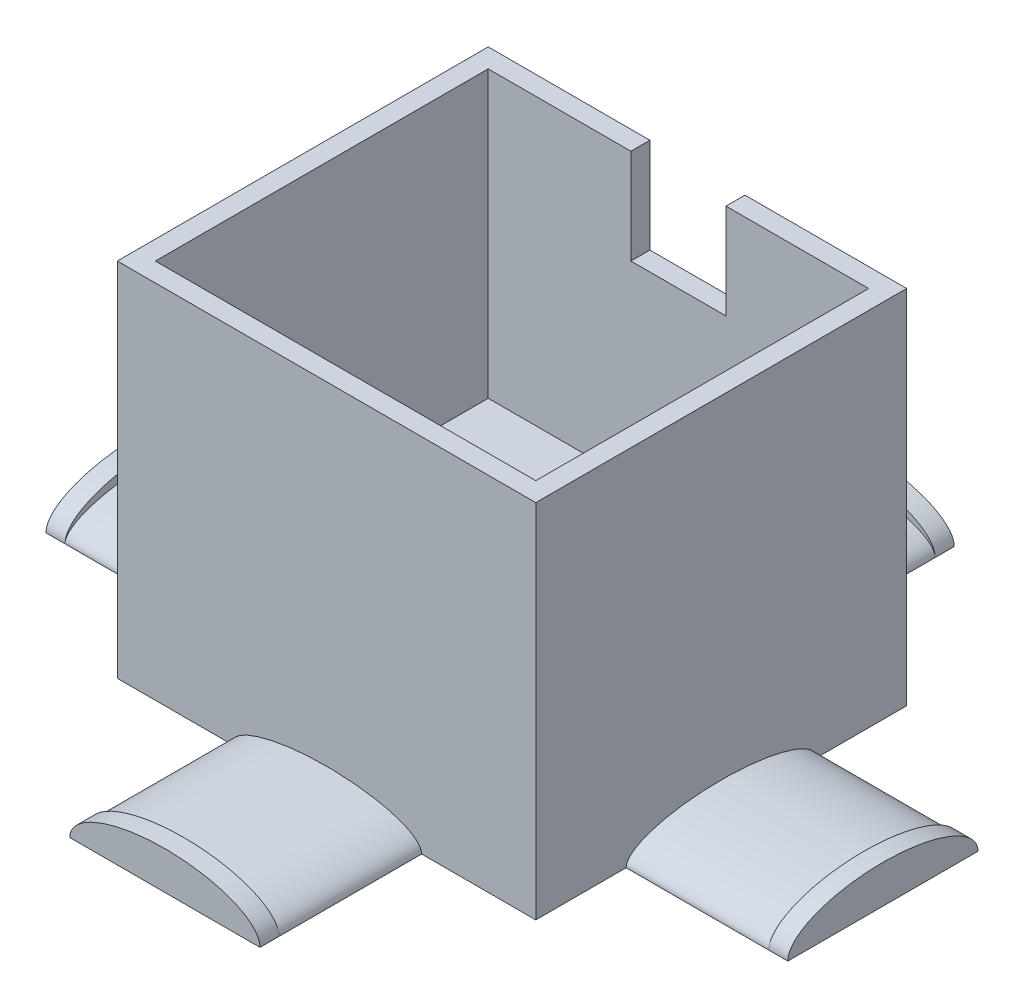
ISO-10303-21;
HEADER;
FILE_DESCRIPTION(('STEP AP214'),'2;1');
FILE_NAME('part.step','',(''),(''),'','','');
FILE_SCHEMA(('AUTOMOTIVE_DESIGN { 1 0 10303 214 1 1 1 1 }'));
ENDSEC;
DATA;
#1=APPLICATION_CONTEXT('core data for automotive mechanical design processes');
#2=APPLICATION_PROTOCOL_DEFINITION('international standard','automotive_design',2000,#1);
#3=PRODUCT_CONTEXT('',#1,'mechanical');
#4=PRODUCT('Part','Part','',(#3));
#5=PRODUCT_RELATED_PRODUCT_CATEGORY('part','',(#4));
#6=PRODUCT_DEFINITION_FORMATION('','',#4);
#7=PRODUCT_DEFINITION_CONTEXT('part definition',#1,'design');
#8=PRODUCT_DEFINITION('design','',#6,#7);
#9=PRODUCT_DEFINITION_SHAPE('','',#8);
#10=(LENGTH_UNIT() NAMED_UNIT(*) SI_UNIT(.MILLI.,.METRE.));
#11=(NAMED_UNIT(*) PLANE_ANGLE_UNIT() SI_UNIT($,.RADIAN.));
#12=(NAMED_UNIT(*) SI_UNIT($,.STERADIAN.) SOLID_ANGLE_UNIT());
#13=UNCERTAINTY_MEASURE_WITH_UNIT(LENGTH_MEASURE(1.E-05),#10,'distance_accuracy_value','');
#14=(GEOMETRIC_REPRESENTATION_CONTEXT(3) GLOBAL_UNCERTAINTY_ASSIGNED_CONTEXT((#13)) GLOBAL_UNIT_ASSIGNED_CONTEXT((#10,
#11,#12)) REPRESENTATION_CONTEXT('',''));
#15=CARTESIAN_POINT('',(0.,0.,0.));
#16=DIRECTION('',(0.,0.,1.));
#17=DIRECTION('',(1.,0.,0.));
#18=AXIS2_PLACEMENT_3D('',#15,#16,#17);
#19=CARTESIAN_POINT('',(0.,32.,0.));
#20=DIRECTION('',(-1.,0.,0.));
#21=DIRECTION('',(0.,0.,1.));
#22=AXIS2_PLACEMENT_3D('',#19,#20,#21);
#23=PLANE('',#22);
#24=CARTESIAN_POINT('',(0.,-6.,-19.5));
#25=DIRECTION('',(1.,0.,0.));
#26=DIRECTION('',(0.,0.,-1.));
#27=AXIS2_PLACEMENT_3D('',#24,#25,#26);
#28=ELLIPSE('',#27,10.,3.);
#29=CARTESIAN_POINT('',(0.,-6.,-29.5));
#30=VERTEX_POINT('',#29);
#31=CARTESIAN_POINT('',(0.,-6.,-9.5));
#32=VERTEX_POINT('',#31);
#33=EDGE_CURVE('E325',#30,#32,#28,.T.);
#34=ORIENTED_EDGE('',*,*,#33,.F.);
#35=DIRECTION('',(0.,0.,1.));
#36=VECTOR('',#35,1.);
#37=CARTESIAN_POINT('',(0.,-6.,0.));
#38=LINE('',#37,#36);
#39=CARTESIAN_POINT('',(0.,-6.,-39.));
#40=VERTEX_POINT('',#39);
#41=EDGE_CURVE('E413',#40,#30,#38,.T.);
#42=ORIENTED_EDGE('',*,*,#41,.F.);
#43=DIRECTION('',(0.,-1.,0.));
#44=VECTOR('',#43,1.);
#45=CARTESIAN_POINT('',(0.,32.,-39.));
#46=LINE('',#45,#44);
#47=CARTESIAN_POINT('',(0.,32.,-39.));
#48=VERTEX_POINT('',#47);
#49=EDGE_CURVE('E471',#48,#40,#46,.T.);
#50=ORIENTED_EDGE('',*,*,#49,.F.);
#51=DIRECTION('',(0.,0.,-1.));
#52=VECTOR('',#51,1.);
#53=CARTESIAN_POINT('',(0.,32.,0.));
#54=LINE('',#53,#52);
#55=CARTESIAN_POINT('',(0.,32.,0.));
#56=VERTEX_POINT('',#55);
#57=EDGE_CURVE('E426',#56,#48,#54,.T.);
#58=ORIENTED_EDGE('',*,*,#57,.F.);
#59=DIRECTION('',(0.,-1.,0.));
#60=VECTOR('',#59,1.);
#61=CARTESIAN_POINT('',(0.,32.,0.));
#62=LINE('',#61,#60);
#63=CARTESIAN_POINT('',(0.,-6.,0.));
#64=VERTEX_POINT('',#63);
#65=EDGE_CURVE('E462',#56,#64,#62,.T.);
#66=ORIENTED_EDGE('',*,*,#65,.T.);
#67=EDGE_CURVE('E412',#32,#64,#38,.T.);
#68=ORIENTED_EDGE('',*,*,#67,.F.);
#69=EDGE_LOOP('',(#34,#42,#50,#58,#66,#68));
#70=FACE_BOUND('',#69,.T.);
#71=ADVANCED_FACE('F41',(#70),#23,.F.);
#72=CARTESIAN_POINT('',(0.,32.,-39.));
#73=DIRECTION('',(0.,0.,1.));
#74=DIRECTION('',(1.,0.,0.));
#75=AXIS2_PLACEMENT_3D('',#72,#73,#74);
#76=PLANE('',#75);
#77=DIRECTION('',(-1.,0.,0.));
#78=VECTOR('',#77,1.);
#79=CARTESIAN_POINT('',(-17.,22.,-39.));
#80=LINE('',#79,#78);
#81=CARTESIAN_POINT('',(-17.,22.,-39.));
#82=VERTEX_POINT('',#81);
#83=CARTESIAN_POINT('',(-27.,22.,-39.));
#84=VERTEX_POINT('',#83);
#85=EDGE_CURVE('E490',#82,#84,#80,.T.);
#86=ORIENTED_EDGE('',*,*,#85,.F.);
#87=DIRECTION('',(0.,-1.,0.));
#88=VECTOR('',#87,1.);
#89=CARTESIAN_POINT('',(-17.,32.,-39.));
#90=LINE('',#89,#88);
#91=CARTESIAN_POINT('',(-17.,32.,-39.));
#92=VERTEX_POINT('',#91);
#93=EDGE_CURVE('E487',#92,#82,#90,.T.);
#94=ORIENTED_EDGE('',*,*,#93,.F.);
#95=DIRECTION('',(-1.,0.,0.));
#96=VECTOR('',#95,1.);
#97=CARTESIAN_POINT('',(0.,32.,-39.));
#98=LINE('',#97,#96);
#99=EDGE_CURVE('E455',#48,#92,#98,.T.);
#100=ORIENTED_EDGE('',*,*,#99,.F.);
#101=ORIENTED_EDGE('',*,*,#49,.T.);
#102=DIRECTION('',(1.,0.,0.));
#103=VECTOR('',#102,1.);
#104=CARTESIAN_POINT('',(-44.,-6.,-39.));
#105=LINE('',#104,#103);
#106=CARTESIAN_POINT('',(-12.,-6.,-39.));
#107=VERTEX_POINT('',#106);
#108=EDGE_CURVE('E408',#107,#40,#105,.T.);
#109=ORIENTED_EDGE('',*,*,#108,.F.);
#110=CARTESIAN_POINT('',(-22.,-6.,-39.));
#111=DIRECTION('',(0.,0.,-1.));
#112=DIRECTION('',(-1.,0.,0.));
#113=AXIS2_PLACEMENT_3D('',#110,#111,#112);
#114=ELLIPSE('',#113,10.,3.);
#115=CARTESIAN_POINT('',(-32.,-6.,-39.));
#116=VERTEX_POINT('',#115);
#117=EDGE_CURVE('E336',#116,#107,#114,.T.);
#118=ORIENTED_EDGE('',*,*,#117,.F.);
#119=CARTESIAN_POINT('',(-44.,-6.,-39.));
#120=VERTEX_POINT('',#119);
#121=EDGE_CURVE('E409',#120,#116,#105,.T.);
#122=ORIENTED_EDGE('',*,*,#121,.F.);
#123=DIRECTION('',(0.,-1.,0.));
#124=VECTOR('',#123,1.);
#125=CARTESIAN_POINT('',(-44.,32.,-39.));
#126=LINE('',#125,#124);
#127=CARTESIAN_POINT('',(-44.,32.,-39.));
#128=VERTEX_POINT('',#127);
#129=EDGE_CURVE('E468',#128,#120,#126,.T.);
#130=ORIENTED_EDGE('',*,*,#129,.F.);
#131=CARTESIAN_POINT('',(-27.,32.,-39.));
#132=VERTEX_POINT('',#131);
#133=EDGE_CURVE('E454',#132,#128,#98,.T.);
#134=ORIENTED_EDGE('',*,*,#133,.F.);
#135=DIRECTION('',(0.,1.,0.));
#136=VECTOR('',#135,1.);
#137=CARTESIAN_POINT('',(-27.,32.,-39.));
#138=LINE('',#137,#136);
#139=EDGE_CURVE('E489',#84,#132,#138,.T.);
#140=ORIENTED_EDGE('',*,*,#139,.F.);
#141=EDGE_LOOP('',(#86,#94,#100,#101,#109,#118,#122,#130,#134,#140));
#142=FACE_BOUND('',#141,.T.);
#143=ADVANCED_FACE('F503',(#142),#76,.F.);
#144=CARTESIAN_POINT('',(-44.,32.,0.));
#145=DIRECTION('',(1.,0.,0.));
#146=DIRECTION('',(0.,0.,-1.));
#147=AXIS2_PLACEMENT_3D('',#144,#145,#146);
#148=PLANE('',#147);
#149=CARTESIAN_POINT('',(-44.,-5.99999999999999,-19.5));
#150=DIRECTION('',(-1.,0.,0.));
#151=DIRECTION('',(0.,0.,1.));
#152=AXIS2_PLACEMENT_3D('',#149,#150,#151);
#153=ELLIPSE('',#152,10.,3.);
#154=CARTESIAN_POINT('',(-44.,-6.,-9.5));
#155=VERTEX_POINT('',#154);
#156=CARTESIAN_POINT('',(-44.,-6.,-29.5));
#157=VERTEX_POINT('',#156);
#158=EDGE_CURVE('E63',#155,#157,#153,.T.);
#159=ORIENTED_EDGE('',*,*,#158,.F.);
#160=DIRECTION('',(0.,0.,-1.));
#161=VECTOR('',#160,1.);
#162=CARTESIAN_POINT('',(-44.,-6.,0.));
#163=LINE('',#162,#161);
#164=CARTESIAN_POINT('',(-44.,-6.,0.));
#165=VERTEX_POINT('',#164);
#166=EDGE_CURVE('E406',#165,#155,#163,.T.);
#167=ORIENTED_EDGE('',*,*,#166,.F.);
#168=DIRECTION('',(0.,-1.,0.));
#169=VECTOR('',#168,1.);
#170=CARTESIAN_POINT('',(-44.,32.,0.));
#171=LINE('',#170,#169);
#172=CARTESIAN_POINT('',(-44.,32.,0.));
#173=VERTEX_POINT('',#172);
#174=EDGE_CURVE('E465',#173,#165,#171,.T.);
#175=ORIENTED_EDGE('',*,*,#174,.F.);
#176=DIRECTION('',(0.,0.,1.));
#177=VECTOR('',#176,1.);
#178=CARTESIAN_POINT('',(-44.,32.,0.));
#179=LINE('',#178,#177);
#180=EDGE_CURVE('E458',#128,#173,#179,.T.);
#181=ORIENTED_EDGE('',*,*,#180,.F.);
#182=ORIENTED_EDGE('',*,*,#129,.T.);
#183=EDGE_CURVE('E403',#157,#120,#163,.T.);
#184=ORIENTED_EDGE('',*,*,#183,.F.);
#185=EDGE_LOOP('',(#159,#167,#175,#181,#182,#184));
#186=FACE_BOUND('',#185,.T.);
#187=ADVANCED_FACE('F507',(#186),#148,.F.);
#188=CARTESIAN_POINT('',(0.,32.,0.));
#189=DIRECTION('',(0.,0.,-1.));
#190=DIRECTION('',(-1.,0.,0.));
#191=AXIS2_PLACEMENT_3D('',#188,#189,#190);
#192=PLANE('',#191);
#193=CARTESIAN_POINT('',(-22.,-6.,0.));
#194=DIRECTION('',(0.,0.,1.));
#195=DIRECTION('',(1.,0.,0.));
#196=AXIS2_PLACEMENT_3D('',#193,#194,#195);
#197=ELLIPSE('',#196,10.,3.);
#198=CARTESIAN_POINT('',(-12.,-6.,0.));
#199=VERTEX_POINT('',#198);
#200=CARTESIAN_POINT('',(-32.,-6.,0.));
#201=VERTEX_POINT('',#200);
#202=EDGE_CURVE('E360',#199,#201,#197,.T.);
#203=ORIENTED_EDGE('',*,*,#202,.F.);
#204=DIRECTION('',(-1.,0.,0.));
#205=VECTOR('',#204,1.);
#206=CARTESIAN_POINT('',(-44.,-6.,0.));
#207=LINE('',#206,#205);
#208=EDGE_CURVE('E416',#64,#199,#207,.T.);
#209=ORIENTED_EDGE('',*,*,#208,.F.);
#210=ORIENTED_EDGE('',*,*,#65,.F.);
#211=DIRECTION('',(1.,0.,0.));
#212=VECTOR('',#211,1.);
#213=CARTESIAN_POINT('',(0.,32.,0.));
#214=LINE('',#213,#212);
#215=EDGE_CURVE('E460',#173,#56,#214,.T.);
#216=ORIENTED_EDGE('',*,*,#215,.F.);
#217=ORIENTED_EDGE('',*,*,#174,.T.);
#218=EDGE_CURVE('E415',#201,#165,#207,.T.);
#219=ORIENTED_EDGE('',*,*,#218,.F.);
#220=EDGE_LOOP('',(#203,#209,#210,#216,#217,#219));
#221=FACE_BOUND('',#220,.T.);
#222=ADVANCED_FACE('F514',(#221),#192,.F.);
#223=CARTESIAN_POINT('',(0.,32.,0.));
#224=DIRECTION('',(0.,1.,0.));
#225=DIRECTION('',(0.,0.,1.));
#226=AXIS2_PLACEMENT_3D('',#223,#224,#225);
#227=PLANE('',#226);
#228=DIRECTION('',(0.,0.,-1.));
#229=VECTOR('',#228,1.);
#230=CARTESIAN_POINT('',(-17.,32.,-29.));
#231=LINE('',#230,#229);
#232=CARTESIAN_POINT('',(-17.,32.,-37.));
#233=VERTEX_POINT('',#232);
#234=EDGE_CURVE('E320',#233,#92,#231,.T.);
#235=ORIENTED_EDGE('',*,*,#234,.F.);
#236=DIRECTION('',(-1.,0.,0.));
#237=VECTOR('',#236,1.);
#238=CARTESIAN_POINT('',(0.,32.,-37.));
#239=LINE('',#238,#237);
#240=CARTESIAN_POINT('',(-2.,32.,-37.));
#241=VERTEX_POINT('',#240);
#242=EDGE_CURVE('E445',#241,#233,#239,.T.);
#243=ORIENTED_EDGE('',*,*,#242,.F.);
#244=DIRECTION('',(0.,0.,-1.));
#245=VECTOR('',#244,1.);
#246=CARTESIAN_POINT('',(-2.,32.,0.));
#247=LINE('',#246,#245);
#248=CARTESIAN_POINT('',(-2.,32.,-2.));
#249=VERTEX_POINT('',#248);
#250=EDGE_CURVE('E442',#249,#241,#247,.T.);
#251=ORIENTED_EDGE('',*,*,#250,.F.);
#252=DIRECTION('',(1.,0.,0.));
#253=VECTOR('',#252,1.);
#254=CARTESIAN_POINT('',(0.,32.,-2.));
#255=LINE('',#254,#253);
#256=CARTESIAN_POINT('',(-42.,32.,-2.));
#257=VERTEX_POINT('',#256);
#258=EDGE_CURVE('E432',#257,#249,#255,.T.);
#259=ORIENTED_EDGE('',*,*,#258,.F.);
#260=DIRECTION('',(0.,0.,1.));
#261=VECTOR('',#260,1.);
#262=CARTESIAN_POINT('',(-42.,32.,0.));
#263=LINE('',#262,#261);
#264=CARTESIAN_POINT('',(-42.,32.,-37.));
#265=VERTEX_POINT('',#264);
#266=EDGE_CURVE('E448',#265,#257,#263,.T.);
#267=ORIENTED_EDGE('',*,*,#266,.F.);
#268=CARTESIAN_POINT('',(-27.,32.,-37.));
#269=VERTEX_POINT('',#268);
#270=EDGE_CURVE('E444',#269,#265,#239,.T.);
#271=ORIENTED_EDGE('',*,*,#270,.F.);
#272=DIRECTION('',(0.,0.,-1.));
#273=VECTOR('',#272,1.);
#274=CARTESIAN_POINT('',(-27.,32.,-29.));
#275=LINE('',#274,#273);
#276=EDGE_CURVE('E478',#269,#132,#275,.T.);
#277=ORIENTED_EDGE('',*,*,#276,.T.);
#278=ORIENTED_EDGE('',*,*,#133,.T.);
#279=ORIENTED_EDGE('',*,*,#180,.T.);
#280=ORIENTED_EDGE('',*,*,#215,.T.);
#281=ORIENTED_EDGE('',*,*,#57,.T.);
#282=ORIENTED_EDGE('',*,*,#99,.T.);
#283=EDGE_LOOP('',(#235,#243,#251,#259,#267,#271,#277,#278,#279,#280,#281,#282));
#284=FACE_BOUND('',#283,.T.);
#285=ADVANCED_FACE('F499',(#284),#227,.T.);
#286=CARTESIAN_POINT('',(-2.,32.,0.));
#287=DIRECTION('',(-1.,0.,0.));
#288=DIRECTION('',(0.,0.,1.));
#289=AXIS2_PLACEMENT_3D('',#286,#287,#288);
#290=PLANE('',#289);
#291=DIRECTION('',(0.,0.,-1.));
#292=VECTOR('',#291,1.);
#293=CARTESIAN_POINT('',(-2.,2.,0.));
#294=LINE('',#293,#292);
#295=CARTESIAN_POINT('',(-2.,2.,-2.));
#296=VERTEX_POINT('',#295);
#297=CARTESIAN_POINT('',(-2.,2.,-37.));
#298=VERTEX_POINT('',#297);
#299=EDGE_CURVE('E419',#296,#298,#294,.T.);
#300=ORIENTED_EDGE('',*,*,#299,.F.);
#301=DIRECTION('',(0.,-1.,0.));
#302=VECTOR('',#301,1.);
#303=CARTESIAN_POINT('',(-2.,32.,-2.));
#304=LINE('',#303,#302);
#305=EDGE_CURVE('E428',#249,#296,#304,.T.);
#306=ORIENTED_EDGE('',*,*,#305,.F.);
#307=ORIENTED_EDGE('',*,*,#250,.T.);
#308=DIRECTION('',(0.,-1.,0.));
#309=VECTOR('',#308,1.);
#310=CARTESIAN_POINT('',(-2.,32.,-37.));
#311=LINE('',#310,#309);
#312=EDGE_CURVE('E423',#241,#298,#311,.T.);
#313=ORIENTED_EDGE('',*,*,#312,.T.);
#314=EDGE_LOOP('',(#300,#306,#307,#313));
#315=FACE_BOUND('',#314,.T.);
#316=ADVANCED_FACE('F523',(#315),#290,.T.);
#317=CARTESIAN_POINT('',(0.,32.,-37.));
#318=DIRECTION('',(0.,0.,1.));
#319=DIRECTION('',(1.,0.,0.));
#320=AXIS2_PLACEMENT_3D('',#317,#318,#319);
#321=PLANE('',#320);
#322=DIRECTION('',(0.,1.,0.));
#323=VECTOR('',#322,1.);
#324=CARTESIAN_POINT('',(-17.,32.,-37.));
#325=LINE('',#324,#323);
#326=CARTESIAN_POINT('',(-17.,22.,-37.));
#327=VERTEX_POINT('',#326);
#328=EDGE_CURVE('E11',#327,#233,#325,.T.);
#329=ORIENTED_EDGE('',*,*,#328,.F.);
#330=DIRECTION('',(1.,0.,0.));
#331=VECTOR('',#330,1.);
#332=CARTESIAN_POINT('',(0.,22.,-37.));
#333=LINE('',#332,#331);
#334=CARTESIAN_POINT('',(-27.,22.,-37.));
#335=VERTEX_POINT('',#334);
#336=EDGE_CURVE('E474',#335,#327,#333,.T.);
#337=ORIENTED_EDGE('',*,*,#336,.F.);
#338=DIRECTION('',(0.,-1.,0.));
#339=VECTOR('',#338,1.);
#340=CARTESIAN_POINT('',(-27.,32.,-37.));
#341=LINE('',#340,#339);
#342=EDGE_CURVE('E48',#269,#335,#341,.T.);
#343=ORIENTED_EDGE('',*,*,#342,.F.);
#344=ORIENTED_EDGE('',*,*,#270,.T.);
#345=DIRECTION('',(0.,-1.,0.));
#346=VECTOR('',#345,1.);
#347=CARTESIAN_POINT('',(-42.,32.,-37.));
#348=LINE('',#347,#346);
#349=CARTESIAN_POINT('',(-42.,2.,-37.));
#350=VERTEX_POINT('',#349);
#351=EDGE_CURVE('E427',#265,#350,#348,.T.);
#352=ORIENTED_EDGE('',*,*,#351,.T.);
#353=DIRECTION('',(-1.,0.,0.));
#354=VECTOR('',#353,1.);
#355=CARTESIAN_POINT('',(0.,2.,-37.));
#356=LINE('',#355,#354);
#357=EDGE_CURVE('E422',#298,#350,#356,.T.);
#358=ORIENTED_EDGE('',*,*,#357,.F.);
#359=ORIENTED_EDGE('',*,*,#312,.F.);
#360=ORIENTED_EDGE('',*,*,#242,.T.);
#361=EDGE_LOOP('',(#329,#337,#343,#344,#352,#358,#359,#360));
#362=FACE_BOUND('',#361,.T.);
#363=ADVANCED_FACE('F482',(#362),#321,.T.);
#364=CARTESIAN_POINT('',(-42.,32.,0.));
#365=DIRECTION('',(1.,0.,0.));
#366=DIRECTION('',(0.,0.,-1.));
#367=AXIS2_PLACEMENT_3D('',#364,#365,#366);
#368=PLANE('',#367);
#369=DIRECTION('',(0.,0.,1.));
#370=VECTOR('',#369,1.);
#371=CARTESIAN_POINT('',(-42.,2.,0.));
#372=LINE('',#371,#370);
#373=CARTESIAN_POINT('',(-42.,2.,-2.));
#374=VERTEX_POINT('',#373);
#375=EDGE_CURVE('E434',#350,#374,#372,.T.);
#376=ORIENTED_EDGE('',*,*,#375,.F.);
#377=ORIENTED_EDGE('',*,*,#351,.F.);
#378=ORIENTED_EDGE('',*,*,#266,.T.);
#379=DIRECTION('',(0.,-1.,0.));
#380=VECTOR('',#379,1.);
#381=CARTESIAN_POINT('',(-42.,32.,-2.));
#382=LINE('',#381,#380);
#383=EDGE_CURVE('E431',#257,#374,#382,.T.);
#384=ORIENTED_EDGE('',*,*,#383,.T.);
#385=EDGE_LOOP('',(#376,#377,#378,#384));
#386=FACE_BOUND('',#385,.T.);
#387=ADVANCED_FACE('F534',(#386),#368,.T.);
#388=CARTESIAN_POINT('',(0.,32.,-2.));
#389=DIRECTION('',(0.,0.,-1.));
#390=DIRECTION('',(-1.,0.,0.));
#391=AXIS2_PLACEMENT_3D('',#388,#389,#390);
#392=PLANE('',#391);
#393=DIRECTION('',(1.,0.,0.));
#394=VECTOR('',#393,1.);
#395=CARTESIAN_POINT('',(0.,2.,-2.));
#396=LINE('',#395,#394);
#397=EDGE_CURVE('E438',#374,#296,#396,.T.);
#398=ORIENTED_EDGE('',*,*,#397,.F.);
#399=ORIENTED_EDGE('',*,*,#383,.F.);
#400=ORIENTED_EDGE('',*,*,#258,.T.);
#401=ORIENTED_EDGE('',*,*,#305,.T.);
#402=EDGE_LOOP('',(#398,#399,#400,#401));
#403=FACE_BOUND('',#402,.T.);
#404=ADVANCED_FACE('F530',(#403),#392,.T.);
#405=CARTESIAN_POINT('',(0.,2.,0.));
#406=DIRECTION('',(0.,1.,0.));
#407=DIRECTION('',(0.,0.,1.));
#408=AXIS2_PLACEMENT_3D('',#405,#406,#407);
#409=PLANE('',#408);
#410=CARTESIAN_POINT('',(-32.025,2.,-19.));
#411=DIRECTION('',(0.,1.,0.));
#412=DIRECTION('',(0.,0.,1.));
#413=AXIS2_PLACEMENT_3D('',#410,#411,#412);
#414=CIRCLE('',#413,2.);
#415=CARTESIAN_POINT('',(-32.025,2.,-17.));
#416=VERTEX_POINT('',#415);
#417=EDGE_CURVE('E374',#416,#416,#414,.T.);
#418=ORIENTED_EDGE('',*,*,#417,.F.);
#419=EDGE_LOOP('',(#418));
#420=FACE_BOUND('',#419,.T.);
#421=CARTESIAN_POINT('',(-11.975,2.,-19.));
#422=DIRECTION('',(0.,1.,0.));
#423=DIRECTION('',(0.,0.,1.));
#424=AXIS2_PLACEMENT_3D('',#421,#422,#423);
#425=CIRCLE('',#424,2.);
#426=CARTESIAN_POINT('',(-11.975,2.,-17.));
#427=VERTEX_POINT('',#426);
#428=EDGE_CURVE('E377',#427,#427,#425,.T.);
#429=ORIENTED_EDGE('',*,*,#428,.F.);
#430=EDGE_LOOP('',(#429));
#431=FACE_BOUND('',#430,.T.);
#432=CARTESIAN_POINT('',(-32.795,2.,-11.76));
#433=DIRECTION('',(0.,1.,0.));
#434=DIRECTION('',(0.,0.,1.));
#435=AXIS2_PLACEMENT_3D('',#432,#433,#434);
#436=CIRCLE('',#435,1.6);
#437=CARTESIAN_POINT('',(-32.795,2.,-10.16));
#438=VERTEX_POINT('',#437);
#439=EDGE_CURVE('E373',#438,#438,#436,.T.);
#440=ORIENTED_EDGE('',*,*,#439,.F.);
#441=EDGE_LOOP('',(#440));
#442=FACE_BOUND('',#441,.T.);
#443=CARTESIAN_POINT('',(-11.205,2.,-11.76));
#444=DIRECTION('',(0.,1.,0.));
#445=DIRECTION('',(0.,0.,1.));
#446=AXIS2_PLACEMENT_3D('',#443,#444,#445);
#447=CIRCLE('',#446,1.6);
#448=CARTESIAN_POINT('',(-11.205,2.,-10.16));
#449=VERTEX_POINT('',#448);
#450=EDGE_CURVE('E392',#449,#449,#447,.T.);
#451=ORIENTED_EDGE('',*,*,#450,.F.);
#452=EDGE_LOOP('',(#451));
#453=FACE_BOUND('',#452,.T.);
#454=CARTESIAN_POINT('',(-11.205,2.,-27.));
#455=DIRECTION('',(0.,1.,0.));
#456=DIRECTION('',(0.,0.,1.));
#457=AXIS2_PLACEMENT_3D('',#454,#455,#456);
#458=CIRCLE('',#457,1.6);
#459=CARTESIAN_POINT('',(-11.205,2.,-25.4));
#460=VERTEX_POINT('',#459);
#461=EDGE_CURVE('E386',#460,#460,#458,.T.);
#462=ORIENTED_EDGE('',*,*,#461,.F.);
#463=EDGE_LOOP('',(#462));
#464=FACE_BOUND('',#463,.T.);
#465=CARTESIAN_POINT('',(-32.795,2.,-27.));
#466=DIRECTION('',(0.,1.,0.));
#467=DIRECTION('',(0.,0.,1.));
#468=AXIS2_PLACEMENT_3D('',#465,#466,#467);
#469=CIRCLE('',#468,1.6);
#470=CARTESIAN_POINT('',(-32.795,2.,-25.4));
#471=VERTEX_POINT('',#470);
#472=EDGE_CURVE('E385',#471,#471,#469,.T.);
#473=ORIENTED_EDGE('',*,*,#472,.F.);
#474=EDGE_LOOP('',(#473));
#475=FACE_BOUND('',#474,.T.);
#476=ORIENTED_EDGE('',*,*,#299,.T.);
#477=ORIENTED_EDGE('',*,*,#357,.T.);
#478=ORIENTED_EDGE('',*,*,#375,.T.);
#479=ORIENTED_EDGE('',*,*,#397,.T.);
#480=EDGE_LOOP('',(#476,#477,#478,#479));
#481=FACE_BOUND('',#480,.T.);
#482=ADVANCED_FACE('F526',(#420,#431,#442,#453,#464,#475,#481),#409,.T.);
#483=CARTESIAN_POINT('',(0.,-6.,0.));
#484=DIRECTION('',(0.,-1.,0.));
#485=DIRECTION('',(0.,0.,-1.));
#486=AXIS2_PLACEMENT_3D('',#483,#484,#485);
#487=PLANE('',#486);
#488=CARTESIAN_POINT('',(-32.025,-6.,-19.));
#489=DIRECTION('',(0.,1.,0.));
#490=DIRECTION('',(0.,0.,1.));
#491=AXIS2_PLACEMENT_3D('',#488,#489,#490);
#492=CIRCLE('',#491,2.);
#493=CARTESIAN_POINT('',(-32.025,-6.,-17.));
#494=VERTEX_POINT('',#493);
#495=EDGE_CURVE('E370',#494,#494,#492,.T.);
#496=ORIENTED_EDGE('',*,*,#495,.T.);
#497=EDGE_LOOP('',(#496));
#498=FACE_BOUND('',#497,.T.);
#499=CARTESIAN_POINT('',(-11.975,-6.,-19.));
#500=DIRECTION('',(0.,1.,0.));
#501=DIRECTION('',(0.,0.,1.));
#502=AXIS2_PLACEMENT_3D('',#499,#500,#501);
#503=CIRCLE('',#502,2.);
#504=CARTESIAN_POINT('',(-11.975,-6.,-17.));
#505=VERTEX_POINT('',#504);
#506=EDGE_CURVE('E369',#505,#505,#503,.T.);
#507=ORIENTED_EDGE('',*,*,#506,.T.);
#508=EDGE_LOOP('',(#507));
#509=FACE_BOUND('',#508,.T.);
#510=CARTESIAN_POINT('',(-32.795,-6.,-11.76));
#511=DIRECTION('',(0.,1.,0.));
#512=DIRECTION('',(0.,0.,1.));
#513=AXIS2_PLACEMENT_3D('',#510,#511,#512);
#514=CIRCLE('',#513,1.6);
#515=CARTESIAN_POINT('',(-32.795,-6.,-10.16));
#516=VERTEX_POINT('',#515);
#517=EDGE_CURVE('E395',#516,#516,#514,.T.);
#518=ORIENTED_EDGE('',*,*,#517,.T.);
#519=EDGE_LOOP('',(#518));
#520=FACE_BOUND('',#519,.T.);
#521=CARTESIAN_POINT('',(-11.205,-6.,-11.76));
#522=DIRECTION('',(0.,1.,0.));
#523=DIRECTION('',(0.,0.,1.));
#524=AXIS2_PLACEMENT_3D('',#521,#522,#523);
#525=CIRCLE('',#524,1.6);
#526=CARTESIAN_POINT('',(-11.205,-6.,-10.16));
#527=VERTEX_POINT('',#526);
#528=EDGE_CURVE('E389',#527,#527,#525,.T.);
#529=ORIENTED_EDGE('',*,*,#528,.T.);
#530=EDGE_LOOP('',(#529));
#531=FACE_BOUND('',#530,.T.);
#532=CARTESIAN_POINT('',(-11.205,-6.,-27.));
#533=DIRECTION('',(0.,1.,0.));
#534=DIRECTION('',(0.,0.,1.));
#535=AXIS2_PLACEMENT_3D('',#532,#533,#534);
#536=CIRCLE('',#535,1.6);
#537=CARTESIAN_POINT('',(-11.205,-6.,-25.4));
#538=VERTEX_POINT('',#537);
#539=EDGE_CURVE('E382',#538,#538,#536,.T.);
#540=ORIENTED_EDGE('',*,*,#539,.T.);
#541=EDGE_LOOP('',(#540));
#542=FACE_BOUND('',#541,.T.);
#543=CARTESIAN_POINT('',(-32.795,-6.,-27.));
#544=DIRECTION('',(0.,1.,0.));
#545=DIRECTION('',(0.,0.,1.));
#546=AXIS2_PLACEMENT_3D('',#543,#544,#545);
#547=CIRCLE('',#546,1.6);
#548=CARTESIAN_POINT('',(-32.795,-6.,-25.4));
#549=VERTEX_POINT('',#548);
#550=EDGE_CURVE('E400',#549,#549,#547,.T.);
#551=ORIENTED_EDGE('',*,*,#550,.T.);
#552=EDGE_LOOP('',(#551));
#553=FACE_BOUND('',#552,.T.);
#554=ORIENTED_EDGE('',*,*,#166,.T.);
#555=DIRECTION('',(1.,0.,0.));
#556=VECTOR('',#555,1.);
#557=CARTESIAN_POINT('',(-59.,-6.,-9.5));
#558=LINE('',#557,#556);
#559=CARTESIAN_POINT('',(-59.,-6.,-9.5));
#560=VERTEX_POINT('',#559);
#561=EDGE_CURVE('E323',#560,#155,#558,.T.);
#562=ORIENTED_EDGE('',*,*,#561,.F.);
#563=DIRECTION('',(1.,0.,0.));
#564=VECTOR('',#563,1.);
#565=CARTESIAN_POINT('',(-61.,-5.99999999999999,-9.5));
#566=LINE('',#565,#564);
#567=CARTESIAN_POINT('',(-61.,-5.99999999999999,-9.5));
#568=VERTEX_POINT('',#567);
#569=EDGE_CURVE('E275',#568,#560,#566,.T.);
#570=ORIENTED_EDGE('',*,*,#569,.F.);
#571=DIRECTION('',(0.,0.,1.));
#572=VECTOR('',#571,1.);
#573=CARTESIAN_POINT('',(-61.,-6.,0.));
#574=LINE('',#573,#572);
#575=CARTESIAN_POINT('',(-61.,-6.,-29.5));
#576=VERTEX_POINT('',#575);
#577=EDGE_CURVE('E267',#576,#568,#574,.T.);
#578=ORIENTED_EDGE('',*,*,#577,.F.);
#579=DIRECTION('',(1.,0.,0.));
#580=VECTOR('',#579,1.);
#581=CARTESIAN_POINT('',(-61.,-6.,-29.5));
#582=LINE('',#581,#580);
#583=CARTESIAN_POINT('',(-59.,-6.,-29.5));
#584=VERTEX_POINT('',#583);
#585=EDGE_CURVE('E266',#576,#584,#582,.T.);
#586=ORIENTED_EDGE('',*,*,#585,.T.);
#587=DIRECTION('',(1.,0.,0.));
#588=VECTOR('',#587,1.);
#589=CARTESIAN_POINT('',(-59.,-6.,-29.5));
#590=LINE('',#589,#588);
#591=EDGE_CURVE('E316',#584,#157,#590,.T.);
#592=ORIENTED_EDGE('',*,*,#591,.T.);
#593=ORIENTED_EDGE('',*,*,#183,.T.);
#594=ORIENTED_EDGE('',*,*,#121,.T.);
#595=DIRECTION('',(0.,0.,1.));
#596=VECTOR('',#595,1.);
#597=CARTESIAN_POINT('',(-32.,-6.,-54.));
#598=LINE('',#597,#596);
#599=CARTESIAN_POINT('',(-32.,-6.,-54.));
#600=VERTEX_POINT('',#599);
#601=EDGE_CURVE('E361',#600,#116,#598,.T.);
#602=ORIENTED_EDGE('',*,*,#601,.F.);
#603=DIRECTION('',(0.,0.,1.));
#604=VECTOR('',#603,1.);
#605=CARTESIAN_POINT('',(-32.,-6.,-56.));
#606=LINE('',#605,#604);
#607=CARTESIAN_POINT('',(-32.,-6.,-56.));
#608=VERTEX_POINT('',#607);
#609=EDGE_CURVE('E272',#608,#600,#606,.T.);
#610=ORIENTED_EDGE('',*,*,#609,.F.);
#611=DIRECTION('',(-1.,0.,0.));
#612=VECTOR('',#611,1.);
#613=CARTESIAN_POINT('',(0.,-6.,-56.));
#614=LINE('',#613,#612);
#615=CARTESIAN_POINT('',(-12.,-6.,-56.));
#616=VERTEX_POINT('',#615);
#617=EDGE_CURVE('E226',#616,#608,#614,.T.);
#618=ORIENTED_EDGE('',*,*,#617,.F.);
#619=DIRECTION('',(0.,0.,1.));
#620=VECTOR('',#619,1.);
#621=CARTESIAN_POINT('',(-12.,-6.,-56.));
#622=LINE('',#621,#620);
#623=CARTESIAN_POINT('',(-12.,-6.,-54.));
#624=VERTEX_POINT('',#623);
#625=EDGE_CURVE('E235',#616,#624,#622,.T.);
#626=ORIENTED_EDGE('',*,*,#625,.T.);
#627=DIRECTION('',(0.,0.,1.));
#628=VECTOR('',#627,1.);
#629=CARTESIAN_POINT('',(-12.,-6.,-54.));
#630=LINE('',#629,#628);
#631=EDGE_CURVE('E341',#624,#107,#630,.T.);
#632=ORIENTED_EDGE('',*,*,#631,.T.);
#633=ORIENTED_EDGE('',*,*,#108,.T.);
#634=ORIENTED_EDGE('',*,*,#41,.T.);
#635=DIRECTION('',(-1.,0.,0.));
#636=VECTOR('',#635,1.);
#637=CARTESIAN_POINT('',(15.,-6.,-29.5));
#638=LINE('',#637,#636);
#639=CARTESIAN_POINT('',(15.,-6.,-29.5));
#640=VERTEX_POINT('',#639);
#641=EDGE_CURVE('E221',#640,#30,#638,.T.);
#642=ORIENTED_EDGE('',*,*,#641,.F.);
#643=DIRECTION('',(-1.,0.,0.));
#644=VECTOR('',#643,1.);
#645=CARTESIAN_POINT('',(17.,-6.,-29.5));
#646=LINE('',#645,#644);
#647=CARTESIAN_POINT('',(17.,-6.,-29.5));
#648=VERTEX_POINT('',#647);
#649=EDGE_CURVE('E206',#648,#640,#646,.T.);
#650=ORIENTED_EDGE('',*,*,#649,.F.);
#651=DIRECTION('',(0.,0.,-1.));
#652=VECTOR('',#651,1.);
#653=CARTESIAN_POINT('',(17.,-6.,0.));
#654=LINE('',#653,#652);
#655=CARTESIAN_POINT('',(17.,-6.,-9.49999999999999));
#656=VERTEX_POINT('',#655);
#657=EDGE_CURVE('E211',#656,#648,#654,.T.);
#658=ORIENTED_EDGE('',*,*,#657,.F.);
#659=DIRECTION('',(-1.,0.,0.));
#660=VECTOR('',#659,1.);
#661=CARTESIAN_POINT('',(17.,-6.,-9.49999999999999));
#662=LINE('',#661,#660);
#663=CARTESIAN_POINT('',(15.,-6.,-9.49999999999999));
#664=VERTEX_POINT('',#663);
#665=EDGE_CURVE('E208',#656,#664,#662,.T.);
#666=ORIENTED_EDGE('',*,*,#665,.T.);
#667=DIRECTION('',(-1.,0.,0.));
#668=VECTOR('',#667,1.);
#669=CARTESIAN_POINT('',(15.,-6.,-9.5));
#670=LINE('',#669,#668);
#671=EDGE_CURVE('E330',#664,#32,#670,.T.);
#672=ORIENTED_EDGE('',*,*,#671,.T.);
#673=ORIENTED_EDGE('',*,*,#67,.T.);
#674=ORIENTED_EDGE('',*,*,#208,.T.);
#675=DIRECTION('',(0.,0.,-1.));
#676=VECTOR('',#675,1.);
#677=CARTESIAN_POINT('',(-12.,-6.,15.));
#678=LINE('',#677,#676);
#679=CARTESIAN_POINT('',(-12.,-6.,15.));
#680=VERTEX_POINT('',#679);
#681=EDGE_CURVE('E366',#680,#199,#678,.T.);
#682=ORIENTED_EDGE('',*,*,#681,.F.);
#683=DIRECTION('',(0.,0.,-1.));
#684=VECTOR('',#683,1.);
#685=CARTESIAN_POINT('',(-12.,-5.99999999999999,17.));
#686=LINE('',#685,#684);
#687=CARTESIAN_POINT('',(-12.,-5.99999999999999,17.));
#688=VERTEX_POINT('',#687);
#689=EDGE_CURVE('E925',#688,#680,#686,.T.);
#690=ORIENTED_EDGE('',*,*,#689,.F.);
#691=DIRECTION('',(1.,0.,0.));
#692=VECTOR('',#691,1.);
#693=CARTESIAN_POINT('',(0.,-6.,17.));
#694=LINE('',#693,#692);
#695=CARTESIAN_POINT('',(-32.,-6.,17.));
#696=VERTEX_POINT('',#695);
#697=EDGE_CURVE('E279',#696,#688,#694,.T.);
#698=ORIENTED_EDGE('',*,*,#697,.F.);
#699=DIRECTION('',(0.,0.,-1.));
#700=VECTOR('',#699,1.);
#701=CARTESIAN_POINT('',(-32.,-6.,17.));
#702=LINE('',#701,#700);
#703=CARTESIAN_POINT('',(-32.,-6.,15.));
#704=VERTEX_POINT('',#703);
#705=EDGE_CURVE('E285',#696,#704,#702,.T.);
#706=ORIENTED_EDGE('',*,*,#705,.T.);
#707=DIRECTION('',(0.,0.,-1.));
#708=VECTOR('',#707,1.);
#709=CARTESIAN_POINT('',(-32.,-6.,15.));
#710=LINE('',#709,#708);
#711=EDGE_CURVE('E359',#704,#201,#710,.T.);
#712=ORIENTED_EDGE('',*,*,#711,.T.);
#713=ORIENTED_EDGE('',*,*,#218,.T.);
#714=EDGE_LOOP('',(#554,#562,#570,#578,#586,#592,#593,#594,#602,#610,#618,#626,#632,#633,#634,
#642,#650,#658,#666,#672,#673,#674,#682,#690,#698,#706,#712,#713));
#715=FACE_BOUND('',#714,.T.);
#716=ADVANCED_FACE('F218',(#498,#509,#520,#531,#542,#553,#715),#487,.T.);
#717=CARTESIAN_POINT('',(-32.795,-6.,-27.));
#718=DIRECTION('',(0.,1.,0.));
#719=DIRECTION('',(0.,0.,1.));
#720=AXIS2_PLACEMENT_3D('',#717,#718,#719);
#721=CYLINDRICAL_SURFACE('',#720,1.6);
#722=ORIENTED_EDGE('',*,*,#550,.F.);
#723=EDGE_LOOP('',(#722));
#724=FACE_BOUND('',#723,.T.);
#725=ORIENTED_EDGE('',*,*,#472,.T.);
#726=EDGE_LOOP('',(#725));
#727=FACE_BOUND('',#726,.T.);
#728=ADVANCED_FACE('F564',(#724,#727),#721,.F.);
#729=CARTESIAN_POINT('',(-11.205,-6.,-27.));
#730=DIRECTION('',(0.,1.,0.));
#731=DIRECTION('',(0.,0.,1.));
#732=AXIS2_PLACEMENT_3D('',#729,#730,#731);
#733=CYLINDRICAL_SURFACE('',#732,1.6);
#734=ORIENTED_EDGE('',*,*,#539,.F.);
#735=EDGE_LOOP('',(#734));
#736=FACE_BOUND('',#735,.T.);
#737=ORIENTED_EDGE('',*,*,#461,.T.);
#738=EDGE_LOOP('',(#737));
#739=FACE_BOUND('',#738,.T.);
#740=ADVANCED_FACE('F580',(#736,#739),#733,.F.);
#741=CARTESIAN_POINT('',(-11.205,-6.,-11.76));
#742=DIRECTION('',(0.,1.,0.));
#743=DIRECTION('',(0.,0.,1.));
#744=AXIS2_PLACEMENT_3D('',#741,#742,#743);
#745=CYLINDRICAL_SURFACE('',#744,1.6);
#746=ORIENTED_EDGE('',*,*,#528,.F.);
#747=EDGE_LOOP('',(#746));
#748=FACE_BOUND('',#747,.T.);
#749=ORIENTED_EDGE('',*,*,#450,.T.);
#750=EDGE_LOOP('',(#749));
#751=FACE_BOUND('',#750,.T.);
#752=ADVANCED_FACE('F586',(#748,#751),#745,.F.);
#753=CARTESIAN_POINT('',(-32.795,-6.,-11.76));
#754=DIRECTION('',(0.,1.,0.));
#755=DIRECTION('',(0.,0.,1.));
#756=AXIS2_PLACEMENT_3D('',#753,#754,#755);
#757=CYLINDRICAL_SURFACE('',#756,1.6);
#758=ORIENTED_EDGE('',*,*,#517,.F.);
#759=EDGE_LOOP('',(#758));
#760=FACE_BOUND('',#759,.T.);
#761=ORIENTED_EDGE('',*,*,#439,.T.);
#762=EDGE_LOOP('',(#761));
#763=FACE_BOUND('',#762,.T.);
#764=ADVANCED_FACE('F591',(#760,#763),#757,.F.);
#765=CARTESIAN_POINT('',(-11.975,-6.,-19.));
#766=DIRECTION('',(0.,1.,0.));
#767=DIRECTION('',(0.,0.,1.));
#768=AXIS2_PLACEMENT_3D('',#765,#766,#767);
#769=CYLINDRICAL_SURFACE('',#768,2.);
#770=ORIENTED_EDGE('',*,*,#506,.F.);
#771=EDGE_LOOP('',(#770));
#772=FACE_BOUND('',#771,.T.);
#773=ORIENTED_EDGE('',*,*,#428,.T.);
#774=EDGE_LOOP('',(#773));
#775=FACE_BOUND('',#774,.T.);
#776=ADVANCED_FACE('F686',(#772,#775),#769,.F.);
#777=CARTESIAN_POINT('',(-32.025,-6.,-19.));
#778=DIRECTION('',(0.,1.,0.));
#779=DIRECTION('',(0.,0.,1.));
#780=AXIS2_PLACEMENT_3D('',#777,#778,#779);
#781=CYLINDRICAL_SURFACE('',#780,2.);
#782=ORIENTED_EDGE('',*,*,#495,.F.);
#783=EDGE_LOOP('',(#782));
#784=FACE_BOUND('',#783,.T.);
#785=ORIENTED_EDGE('',*,*,#417,.T.);
#786=EDGE_LOOP('',(#785));
#787=FACE_BOUND('',#786,.T.);
#788=ADVANCED_FACE('F351',(#784,#787),#781,.F.);
#789=CARTESIAN_POINT('',(-22.,-6.,15.));
#790=DIRECTION('',(0.,0.,1.));
#791=DIRECTION('',(1.,0.,0.));
#792=AXIS2_PLACEMENT_3D('',#789,#790,#791);
#793=ELLIPSE('',#792,10.,3.);
#794=DIRECTION('',(0.,0.,-1.));
#795=VECTOR('',#794,1.);
#796=SURFACE_OF_LINEAR_EXTRUSION('',#793,#795);
#797=ORIENTED_EDGE('',*,*,#202,.T.);
#798=ORIENTED_EDGE('',*,*,#711,.F.);
#799=EDGE_CURVE('E354',#680,#704,#793,.T.);
#800=ORIENTED_EDGE('',*,*,#799,.F.);
#801=ORIENTED_EDGE('',*,*,#681,.T.);
#802=EDGE_LOOP('',(#797,#798,#800,#801));
#803=FACE_BOUND('',#802,.T.);
#804=ADVANCED_FACE('F346',(#803),#796,.F.);
#805=CARTESIAN_POINT('',(-22.,-6.,-54.));
#806=DIRECTION('',(0.,0.,-1.));
#807=DIRECTION('',(-1.,0.,0.));
#808=AXIS2_PLACEMENT_3D('',#805,#806,#807);
#809=ELLIPSE('',#808,10.,3.);
#810=DIRECTION('',(0.,0.,1.));
#811=VECTOR('',#810,1.);
#812=SURFACE_OF_LINEAR_EXTRUSION('',#809,#811);
#813=ORIENTED_EDGE('',*,*,#117,.T.);
#814=ORIENTED_EDGE('',*,*,#631,.F.);
#815=EDGE_CURVE('E337',#600,#624,#809,.T.);
#816=ORIENTED_EDGE('',*,*,#815,.F.);
#817=ORIENTED_EDGE('',*,*,#601,.T.);
#818=EDGE_LOOP('',(#813,#814,#816,#817));
#819=FACE_BOUND('',#818,.T.);
#820=ADVANCED_FACE('F343',(#819),#812,.F.);
#821=CARTESIAN_POINT('',(15.,-6.,-19.5));
#822=DIRECTION('',(1.,0.,0.));
#823=DIRECTION('',(0.,0.,-1.));
#824=AXIS2_PLACEMENT_3D('',#821,#822,#823);
#825=ELLIPSE('',#824,10.,3.);
#826=DIRECTION('',(-1.,0.,0.));
#827=VECTOR('',#826,1.);
#828=SURFACE_OF_LINEAR_EXTRUSION('',#825,#827);
#829=ORIENTED_EDGE('',*,*,#33,.T.);
#830=ORIENTED_EDGE('',*,*,#671,.F.);
#831=EDGE_CURVE('E326',#640,#664,#825,.T.);
#832=ORIENTED_EDGE('',*,*,#831,.F.);
#833=ORIENTED_EDGE('',*,*,#641,.T.);
#834=EDGE_LOOP('',(#829,#830,#832,#833));
#835=FACE_BOUND('',#834,.T.);
#836=ADVANCED_FACE('F307',(#835),#828,.F.);
#837=CARTESIAN_POINT('',(-59.,-5.99999999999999,-19.5));
#838=DIRECTION('',(-1.,0.,0.));
#839=DIRECTION('',(0.,0.,1.));
#840=AXIS2_PLACEMENT_3D('',#837,#838,#839);
#841=ELLIPSE('',#840,10.,3.);
#842=DIRECTION('',(1.,0.,0.));
#843=VECTOR('',#842,1.);
#844=SURFACE_OF_LINEAR_EXTRUSION('',#841,#843);
#845=ORIENTED_EDGE('',*,*,#158,.T.);
#846=ORIENTED_EDGE('',*,*,#591,.F.);
#847=EDGE_CURVE('E311',#560,#584,#841,.T.);
#848=ORIENTED_EDGE('',*,*,#847,.F.);
#849=ORIENTED_EDGE('',*,*,#561,.T.);
#850=EDGE_LOOP('',(#845,#846,#848,#849));
#851=FACE_BOUND('',#850,.T.);
#852=ADVANCED_FACE('F302',(#851),#844,.F.);
#853=CARTESIAN_POINT('',(-17.,32.,-29.));
#854=DIRECTION('',(1.,0.,0.));
#855=DIRECTION('',(0.,0.,-1.));
#856=AXIS2_PLACEMENT_3D('',#853,#854,#855);
#857=PLANE('',#856);
#858=ORIENTED_EDGE('',*,*,#328,.T.);
#859=ORIENTED_EDGE('',*,*,#234,.T.);
#860=ORIENTED_EDGE('',*,*,#93,.T.);
#861=DIRECTION('',(0.,0.,-1.));
#862=VECTOR('',#861,1.);
#863=CARTESIAN_POINT('',(-17.,22.,-29.));
#864=LINE('',#863,#862);
#865=EDGE_CURVE('E317',#327,#82,#864,.T.);
#866=ORIENTED_EDGE('',*,*,#865,.F.);
#867=EDGE_LOOP('',(#858,#859,#860,#866));
#868=FACE_BOUND('',#867,.T.);
#869=ADVANCED_FACE('F296',(#868),#857,.F.);
#870=CARTESIAN_POINT('',(-27.,32.,-29.));
#871=DIRECTION('',(-1.,0.,0.));
#872=DIRECTION('',(0.,-1.,0.));
#873=AXIS2_PLACEMENT_3D('',#870,#871,#872);
#874=PLANE('',#873);
#875=ORIENTED_EDGE('',*,*,#342,.T.);
#876=DIRECTION('',(0.,0.,-1.));
#877=VECTOR('',#876,1.);
#878=CARTESIAN_POINT('',(-27.,22.,-29.));
#879=LINE('',#878,#877);
#880=EDGE_CURVE('E55',#335,#84,#879,.T.);
#881=ORIENTED_EDGE('',*,*,#880,.T.);
#882=ORIENTED_EDGE('',*,*,#139,.T.);
#883=ORIENTED_EDGE('',*,*,#276,.F.);
#884=EDGE_LOOP('',(#875,#881,#882,#883));
#885=FACE_BOUND('',#884,.T.);
#886=ADVANCED_FACE('F293',(#885),#874,.F.);
#887=CARTESIAN_POINT('',(-17.,22.,-29.));
#888=DIRECTION('',(0.,-1.,0.));
#889=DIRECTION('',(1.,0.,0.));
#890=AXIS2_PLACEMENT_3D('',#887,#888,#889);
#891=PLANE('',#890);
#892=ORIENTED_EDGE('',*,*,#336,.T.);
#893=ORIENTED_EDGE('',*,*,#865,.T.);
#894=ORIENTED_EDGE('',*,*,#85,.T.);
#895=ORIENTED_EDGE('',*,*,#880,.F.);
#896=EDGE_LOOP('',(#892,#893,#894,#895));
#897=FACE_BOUND('',#896,.T.);
#898=ADVANCED_FACE('F291',(#897),#891,.F.);
#899=CARTESIAN_POINT('',(-22.,-6.,17.));
#900=DIRECTION('',(0.,0.,1.));
#901=DIRECTION('',(1.,0.,0.));
#902=AXIS2_PLACEMENT_3D('',#899,#900,#901);
#903=ELLIPSE('',#902,10.,4.);
#904=DIRECTION('',(0.,0.,-1.));
#905=VECTOR('',#904,1.);
#906=SURFACE_OF_LINEAR_EXTRUSION('',#903,#905);
#907=CARTESIAN_POINT('',(-22.,-6.,15.));
#908=DIRECTION('',(0.,0.,1.));
#909=DIRECTION('',(1.,0.,0.));
#910=AXIS2_PLACEMENT_3D('',#907,#908,#909);
#911=ELLIPSE('',#910,10.,4.);
#912=EDGE_CURVE('E278',#680,#704,#911,.T.);
#913=ORIENTED_EDGE('',*,*,#912,.T.);
#914=ORIENTED_EDGE('',*,*,#705,.F.);
#915=EDGE_CURVE('E282',#688,#696,#903,.T.);
#916=ORIENTED_EDGE('',*,*,#915,.F.);
#917=ORIENTED_EDGE('',*,*,#689,.T.);
#918=EDGE_LOOP('',(#913,#914,#916,#917));
#919=FACE_BOUND('',#918,.T.);
#920=ADVANCED_FACE('F288',(#919),#906,.F.);
#921=CARTESIAN_POINT('',(0.,0.,17.));
#922=DIRECTION('',(0.,0.,1.));
#923=DIRECTION('',(1.,0.,0.));
#924=AXIS2_PLACEMENT_3D('',#921,#922,#923);
#925=PLANE('',#924);
#926=ORIENTED_EDGE('',*,*,#697,.T.);
#927=ORIENTED_EDGE('',*,*,#915,.T.);
#928=EDGE_LOOP('',(#926,#927));
#929=FACE_BOUND('',#928,.T.);
#930=ADVANCED_FACE('F260',(#929),#925,.T.);
#931=CARTESIAN_POINT('',(0.,0.,15.));
#932=DIRECTION('',(0.,0.,1.));
#933=DIRECTION('',(1.,0.,0.));
#934=AXIS2_PLACEMENT_3D('',#931,#932,#933);
#935=PLANE('',#934);
#936=ORIENTED_EDGE('',*,*,#912,.F.);
#937=ORIENTED_EDGE('',*,*,#799,.T.);
#938=EDGE_LOOP('',(#936,#937));
#939=FACE_BOUND('',#938,.T.);
#940=ADVANCED_FACE('F258',(#939),#935,.F.);
#941=CARTESIAN_POINT('',(-61.,-6.,-19.5));
#942=DIRECTION('',(-1.,0.,0.));
#943=DIRECTION('',(0.,0.,1.));
#944=AXIS2_PLACEMENT_3D('',#941,#942,#943);
#945=ELLIPSE('',#944,10.,4.);
#946=DIRECTION('',(1.,0.,0.));
#947=VECTOR('',#946,1.);
#948=SURFACE_OF_LINEAR_EXTRUSION('',#945,#947);
#949=CARTESIAN_POINT('',(-59.,-6.,-19.5));
#950=DIRECTION('',(-1.,0.,0.));
#951=DIRECTION('',(0.,0.,1.));
#952=AXIS2_PLACEMENT_3D('',#949,#950,#951);
#953=ELLIPSE('',#952,10.,4.);
#954=EDGE_CURVE('E269',#560,#584,#953,.T.);
#955=ORIENTED_EDGE('',*,*,#954,.T.);
#956=ORIENTED_EDGE('',*,*,#585,.F.);
#957=EDGE_CURVE('E262',#568,#576,#945,.T.);
#958=ORIENTED_EDGE('',*,*,#957,.F.);
#959=ORIENTED_EDGE('',*,*,#569,.T.);
#960=EDGE_LOOP('',(#955,#956,#958,#959));
#961=FACE_BOUND('',#960,.T.);
#962=ADVANCED_FACE('F250',(#961),#948,.F.);
#963=CARTESIAN_POINT('',(-61.,0.,0.));
#964=DIRECTION('',(-1.,0.,0.));
#965=DIRECTION('',(0.,0.,1.));
#966=AXIS2_PLACEMENT_3D('',#963,#964,#965);
#967=PLANE('',#966);
#968=ORIENTED_EDGE('',*,*,#577,.T.);
#969=ORIENTED_EDGE('',*,*,#957,.T.);
#970=EDGE_LOOP('',(#968,#969));
#971=FACE_BOUND('',#970,.T.);
#972=ADVANCED_FACE('F247',(#971),#967,.T.);
#973=CARTESIAN_POINT('',(-59.,0.,0.));
#974=DIRECTION('',(-1.,0.,0.));
#975=DIRECTION('',(0.,0.,1.));
#976=AXIS2_PLACEMENT_3D('',#973,#974,#975);
#977=PLANE('',#976);
#978=ORIENTED_EDGE('',*,*,#954,.F.);
#979=ORIENTED_EDGE('',*,*,#847,.T.);
#980=EDGE_LOOP('',(#978,#979));
#981=FACE_BOUND('',#980,.T.);
#982=ADVANCED_FACE('F243',(#981),#977,.F.);
#983=CARTESIAN_POINT('',(-22.,-6.,-56.));
#984=DIRECTION('',(0.,0.,-1.));
#985=DIRECTION('',(1.,0.,0.));
#986=AXIS2_PLACEMENT_3D('',#983,#984,#985);
#987=ELLIPSE('',#986,10.,4.);
#988=DIRECTION('',(0.,0.,1.));
#989=VECTOR('',#988,1.);
#990=SURFACE_OF_LINEAR_EXTRUSION('',#987,#989);
#991=CARTESIAN_POINT('',(-22.,-6.,-54.));
#992=DIRECTION('',(0.,0.,-1.));
#993=DIRECTION('',(1.,0.,0.));
#994=AXIS2_PLACEMENT_3D('',#991,#992,#993);
#995=ELLIPSE('',#994,10.,4.);
#996=EDGE_CURVE('E223',#600,#624,#995,.T.);
#997=ORIENTED_EDGE('',*,*,#996,.T.);
#998=ORIENTED_EDGE('',*,*,#625,.F.);
#999=EDGE_CURVE('E233',#608,#616,#987,.T.);
#1000=ORIENTED_EDGE('',*,*,#999,.F.);
#1001=ORIENTED_EDGE('',*,*,#609,.T.);
#1002=EDGE_LOOP('',(#997,#998,#1000,#1001));
#1003=FACE_BOUND('',#1002,.T.);
#1004=ADVANCED_FACE('F238',(#1003),#990,.F.);
#1005=CARTESIAN_POINT('',(0.,0.,-56.));
#1006=DIRECTION('',(0.,0.,-1.));
#1007=DIRECTION('',(-1.,0.,0.));
#1008=AXIS2_PLACEMENT_3D('',#1005,#1006,#1007);
#1009=PLANE('',#1008);
#1010=ORIENTED_EDGE('',*,*,#617,.T.);
#1011=ORIENTED_EDGE('',*,*,#999,.T.);
#1012=EDGE_LOOP('',(#1010,#1011));
#1013=FACE_BOUND('',#1012,.T.);
#1014=ADVANCED_FACE('F242',(#1013),#1009,.T.);
#1015=CARTESIAN_POINT('',(0.,0.,-54.));
#1016=DIRECTION('',(0.,0.,-1.));
#1017=DIRECTION('',(-1.,0.,0.));
#1018=AXIS2_PLACEMENT_3D('',#1015,#1016,#1017);
#1019=PLANE('',#1018);
#1020=ORIENTED_EDGE('',*,*,#996,.F.);
#1021=ORIENTED_EDGE('',*,*,#815,.T.);
#1022=EDGE_LOOP('',(#1020,#1021));
#1023=FACE_BOUND('',#1022,.T.);
#1024=ADVANCED_FACE('F245',(#1023),#1019,.F.);
#1025=CARTESIAN_POINT('',(17.,-6.,-19.5));
#1026=DIRECTION('',(1.,0.,0.));
#1027=DIRECTION('',(0.,0.,-1.));
#1028=AXIS2_PLACEMENT_3D('',#1025,#1026,#1027);
#1029=ELLIPSE('',#1028,10.,4.);
#1030=DIRECTION('',(-1.,0.,0.));
#1031=VECTOR('',#1030,1.);
#1032=SURFACE_OF_LINEAR_EXTRUSION('',#1029,#1031);
#1033=CARTESIAN_POINT('',(15.,-6.,-19.5));
#1034=DIRECTION('',(1.,0.,0.));
#1035=DIRECTION('',(0.,0.,-1.));
#1036=AXIS2_PLACEMENT_3D('',#1033,#1034,#1035);
#1037=ELLIPSE('',#1036,10.,4.);
#1038=EDGE_CURVE('E215',#640,#664,#1037,.T.);
#1039=ORIENTED_EDGE('',*,*,#1038,.T.);
#1040=ORIENTED_EDGE('',*,*,#665,.F.);
#1041=EDGE_CURVE('E201',#648,#656,#1029,.T.);
#1042=ORIENTED_EDGE('',*,*,#1041,.F.);
#1043=ORIENTED_EDGE('',*,*,#649,.T.);
#1044=EDGE_LOOP('',(#1039,#1040,#1042,#1043));
#1045=FACE_BOUND('',#1044,.T.);
#1046=ADVANCED_FACE('F204',(#1045),#1032,.F.);
#1047=CARTESIAN_POINT('',(17.,0.,0.));
#1048=DIRECTION('',(1.,0.,0.));
#1049=DIRECTION('',(0.,0.,-1.));
#1050=AXIS2_PLACEMENT_3D('',#1047,#1048,#1049);
#1051=PLANE('',#1050);
#1052=ORIENTED_EDGE('',*,*,#657,.T.);
#1053=ORIENTED_EDGE('',*,*,#1041,.T.);
#1054=EDGE_LOOP('',(#1052,#1053));
#1055=FACE_BOUND('',#1054,.T.);
#1056=ADVANCED_FACE('F213',(#1055),#1051,.T.);
#1057=CARTESIAN_POINT('',(15.,0.,0.));
#1058=DIRECTION('',(1.,0.,0.));
#1059=DIRECTION('',(0.,0.,-1.));
#1060=AXIS2_PLACEMENT_3D('',#1057,#1058,#1059);
#1061=PLANE('',#1060);
#1062=ORIENTED_EDGE('',*,*,#1038,.F.);
#1063=ORIENTED_EDGE('',*,*,#831,.T.);
#1064=EDGE_LOOP('',(#1062,#1063));
#1065=FACE_BOUND('',#1064,.T.);
#1066=ADVANCED_FACE('F821',(#1065),#1061,.F.);
#1067=CLOSED_SHELL('',(#71,#143,#187,#222,#285,#316,#363,#387,#404,#482,#716,#728,#740,#752,
#764,#776,#788,#804,#820,#836,#852,#869,#886,#898,#920,#930,#940,#962,#972,#982,#1004,#1014,
#1024,#1046,#1056,#1066));
#1068=MANIFOLD_SOLID_BREP('B2',#1067);
#1069=ADVANCED_BREP_SHAPE_REPRESENTATION('',(#18,#1068),#14);
#1070=SHAPE_DEFINITION_REPRESENTATION(#9,#1069);
ENDSEC;
END-ISO-10303-21;
